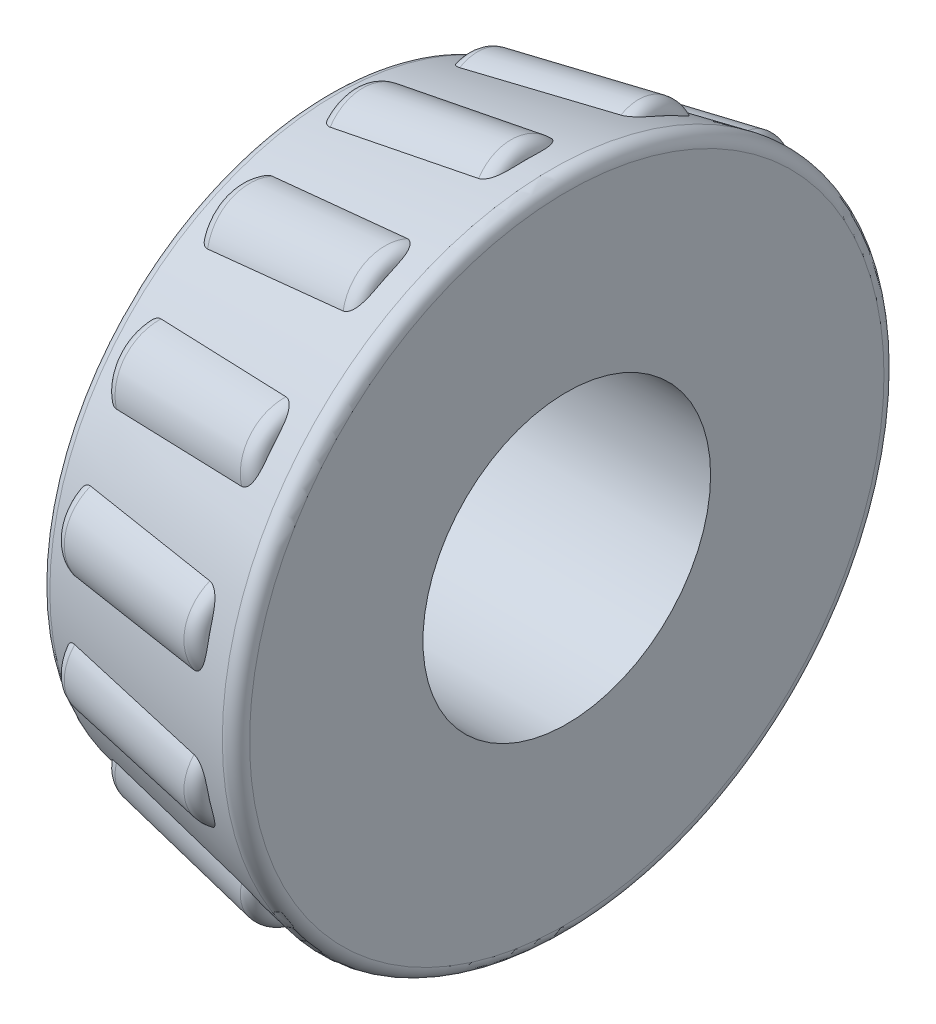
from build123d import *

# Parameters (mm, degrees)
FILLET1_R         = 0.762
CIRPATTERN2_COUNT = 14
FILLET2_R         = 0.762


with BuildPart() as part:
    # Sketch1 → Revolve1 (revolve)
    with BuildSketch(Plane.XY, mode=Mode.PRIVATE) as revolve1_sk:
        Polygon((0, 8.75), (-14.605, 8.75), (-14.605, 17.3355), (0, 20.22475), align=None)
    revolve(revolve1_sk.sketch.rotate(Axis((0, 0, 0), (-1, 0, 0)), 90), axis=Axis((0, 0, 0), (-1, 0, 0)))

    # Fillet2
    fillet2_edges = [part.edges().sort_by_distance(p)[0] for p in [
        (0, 0, 20.22475),
        (-14.605, 0, 17.3355),
    ]]
    fillet(fillet2_edges, radius=FILLET2_R)


with BuildPart() as body_2:
    # Sketch2 → Revolve2 (revolve)
    with BuildSketch(Plane.XY, mode=Mode.PRIVATE) as revolve2_sk:
        Polygon((-13.149029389, 18.41896875), (-2.638991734, 20.498128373), (-2.047481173, 17.508074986), (-12.557518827, 15.428915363), align=None)
    revolve(revolve2_sk.sketch.rotate(Axis((-12.557518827, 15.428915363, 0), (0.9809886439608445, 0.19406514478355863, 0)), 180), axis=Axis((-12.557518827, 15.428915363, 0), (0.9809886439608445, 0.19406514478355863, 0)))

    # Fillet1
    fillet1_edges = [body_2.edges().sort_by_distance(p)[0] for p in [
        (-2.638991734, 20.498128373, 0),
        (-13.149029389, 18.41896875, 0),
    ]]
    fillet(fillet1_edges, radius=FILLET1_R)


with BuildPart() as cirpattern2_1:
    # CirPattern2: pattern copy
    add(body_2.part.rotate(Axis((0, 0, 0), (1, 0, 0)), 1 * 360 / CIRPATTERN2_COUNT))


with BuildPart() as cirpattern2_2:
    # CirPattern2: pattern copy
    add(body_2.part.rotate(Axis((0, 0, 0), (1, 0, 0)), 2 * 360 / CIRPATTERN2_COUNT))


with BuildPart() as cirpattern2_3:
    # CirPattern2: pattern copy
    add(body_2.part.rotate(Axis((0, 0, 0), (1, 0, 0)), 3 * 360 / CIRPATTERN2_COUNT))


with BuildPart() as cirpattern2_4:
    # CirPattern2: pattern copy
    add(body_2.part.rotate(Axis((0, 0, 0), (1, 0, 0)), 4 * 360 / CIRPATTERN2_COUNT))


with BuildPart() as cirpattern2_5:
    # CirPattern2: pattern copy
    add(body_2.part.rotate(Axis((0, 0, 0), (1, 0, 0)), 5 * 360 / CIRPATTERN2_COUNT))


with BuildPart() as cirpattern2_6:
    # CirPattern2: pattern copy
    add(body_2.part.rotate(Axis((0, 0, 0), (1, 0, 0)), 6 * 360 / CIRPATTERN2_COUNT))


with BuildPart() as cirpattern2_7:
    # CirPattern2: pattern copy
    add(body_2.part.rotate(Axis((0, 0, 0), (1, 0, 0)), 7 * 360 / CIRPATTERN2_COUNT))


with BuildPart() as cirpattern2_8:
    # CirPattern2: pattern copy
    add(body_2.part.rotate(Axis((0, 0, 0), (1, 0, 0)), 8 * 360 / CIRPATTERN2_COUNT))


with BuildPart() as cirpattern2_9:
    # CirPattern2: pattern copy
    add(body_2.part.rotate(Axis((0, 0, 0), (1, 0, 0)), 9 * 360 / CIRPATTERN2_COUNT))


with BuildPart() as cirpattern2_10:
    # CirPattern2: pattern copy
    add(body_2.part.rotate(Axis((0, 0, 0), (1, 0, 0)), 10 * 360 / CIRPATTERN2_COUNT))


with BuildPart() as cirpattern2_11:
    # CirPattern2: pattern copy
    add(body_2.part.rotate(Axis((0, 0, 0), (1, 0, 0)), 11 * 360 / CIRPATTERN2_COUNT))


with BuildPart() as cirpattern2_12:
    # CirPattern2: pattern copy
    add(body_2.part.rotate(Axis((0, 0, 0), (1, 0, 0)), 12 * 360 / CIRPATTERN2_COUNT))


with BuildPart() as cirpattern2_13:
    # CirPattern2: pattern copy
    add(body_2.part.rotate(Axis((0, 0, 0), (1, 0, 0)), 13 * 360 / CIRPATTERN2_COUNT))


with BuildPart() as body_2_1:
    add(body_2.part)

    # Combine1: union CirPattern2_13, CirPattern2_12, CirPattern2_11, CirPattern2_10, CirPattern2_9, CirPattern2_8, CirPattern2_7, CirPattern2_6, CirPattern2_5, CirPattern2_4, CirPattern2_3, CirPattern2_2, CirPattern2_1, part
    add(cirpattern2_13.part)
    add(cirpattern2_12.part)
    add(cirpattern2_11.part)
    add(cirpattern2_10.part)
    add(cirpattern2_9.part)
    add(cirpattern2_8.part)
    add(cirpattern2_7.part)
    add(cirpattern2_6.part)
    add(cirpattern2_5.part)
    add(cirpattern2_4.part)
    add(cirpattern2_3.part)
    add(cirpattern2_2.part)
    add(cirpattern2_1.part)
    add(part.part)


solid = body_2_1.part
